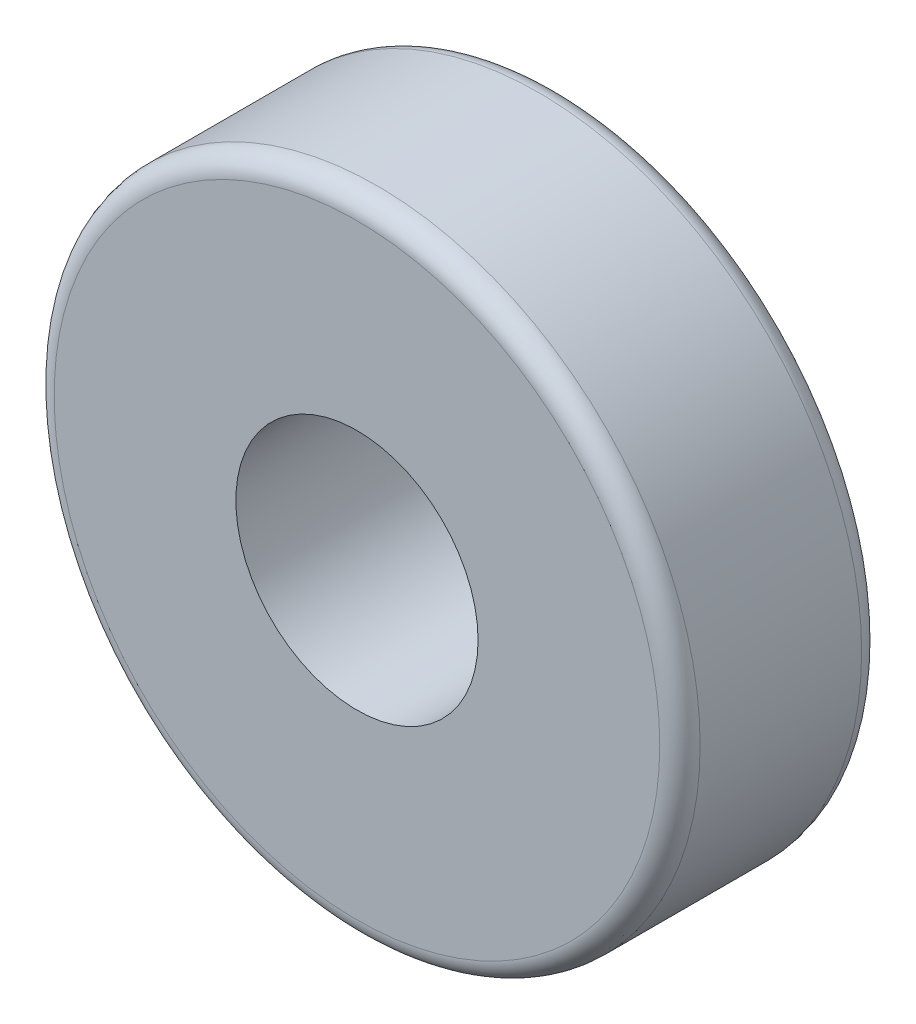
from build123d import *

# Parameters (mm, degrees)
ESQUISSE1_R      = 16
ESQUISSE1_R_2    = 6
EXTRUSION1_DEPTH = 10
CONG_1_R         = 1


with BuildPart() as part:
    # Esquisse1 → Extrusion1 (new body)
    with BuildSketch(Plane.XY):
        Circle(ESQUISSE1_R)
        Circle(ESQUISSE1_R_2, mode=Mode.SUBTRACT)
    extrude(amount=EXTRUSION1_DEPTH)

    # Cong_1
    cong_1_edges = [part.edges().sort_by_distance(p)[0] for p in [
        (-16, 0, 0),
        (-16, 0, 10),
        (-6, 0, 0),
    ]]
    fillet(cong_1_edges, radius=CONG_1_R)


solid = part.part
